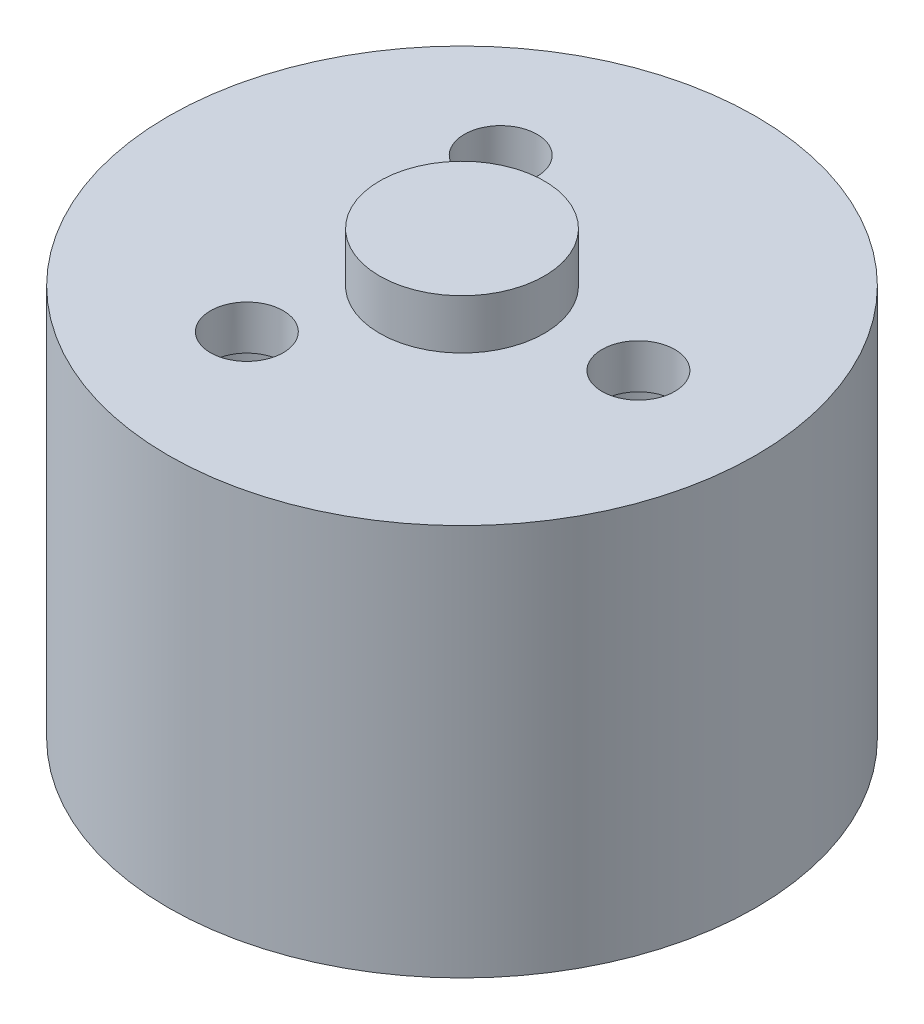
from build123d import *

# Parameters (mm, degrees)
SKETCH1_R                      = 8.875
EXTRUDE1_DEPTH                 = 11.83716
SKETCH2_R                      = 2.4892
EXTRUDE2_DEPTH                 = 1.5
SKETCH3_R                      = 2.4892
EXTRUDE3_DEPTH                 = 1.5
CBORE_FOR_M2_SHCS1_D           = 2.2
CBORE_FOR_M2_SHCS1_CBORE_D     = 4.4
CBORE_FOR_M2_SHCS1_CBORE_DEPTH = 10.5
CIRPATTERN1_COUNT              = 3
CIRPATTERN2_COUNT              = 3


with BuildPart() as part:
    # Sketch1 → Extrude1 (new body)
    with BuildSketch(Plane(origin=(0, 0, 0), x_dir=(1, 0, 0), z_dir=(0, 1, 0))):
        with Locations(Location((0, 0, 0), (0, 0, 90))):
            Circle(SKETCH1_R)
    extrude(amount=EXTRUDE1_DEPTH)

    # Sketch2 → Extrude2 (add)
    with BuildSketch(Plane(origin=(0, 11.83716, 0), x_dir=(1, 0, 0), z_dir=(0, 1, 0))):
        with Locations(Location((0, 0, 0), (0, 0, 270))):
            Circle(SKETCH2_R)
    extrude(amount=EXTRUDE2_DEPTH)

    # Sketch3 → Extrude3 (cut)
    with BuildSketch(Plane.XZ):
        with Locations(Location((0, 0, 0), (0, 0, 90))):
            Circle(SKETCH3_R)
    extrude(amount=-EXTRUDE3_DEPTH, mode=Mode.SUBTRACT)

    # CBORE for M2 SHCS1 (through all)
    with Locations(Plane.XZ):
        with Locations((4.879209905, -0.450899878)):
            cbore_for_m2_shcs1 = CounterBoreHole(CBORE_FOR_M2_SHCS1_D / 2, CBORE_FOR_M2_SHCS1_CBORE_D / 2, CBORE_FOR_M2_SHCS1_CBORE_DEPTH)

    # CirPattern1: CBORE for M2 SHCS1 ×3 about axis
    cirpattern1_axis = Axis((0, 0, 0), (0, 1, 0))
    for i in range(1, CIRPATTERN1_COUNT):
        add(cbore_for_m2_shcs1.rotate(cirpattern1_axis, i * 360 / CIRPATTERN1_COUNT), mode=Mode.SUBTRACT)

    # Sketch6 → M2x0.4 Tapped Hole1 (revolve, cut)
    with BuildSketch(Plane(origin=(2.830095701, 0, 4.00006979), x_dir=(0, 0, -1), z_dir=(1, 0, 0))):
        Polygon((0, 0), (0, 6.680688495), (0.8, 6.2), (0.8, 5), (1, 5), (1, 0), align=None)
    m2x0_4_tapped_hole1 = revolve(axis=Axis((2.830095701, -6.35, 4.00006979), (0, 1, 0)), mode=Mode.SUBTRACT)

    # CirPattern2: M2x0.4 Tapped Hole1 ×3 about axis
    cirpattern2_axis = Axis((0, 0, 0), (0, 1, 0))
    for i in range(1, CIRPATTERN2_COUNT):
        add(m2x0_4_tapped_hole1.rotate(cirpattern2_axis, i * 360 / CIRPATTERN2_COUNT), mode=Mode.SUBTRACT)


solid = part.part
